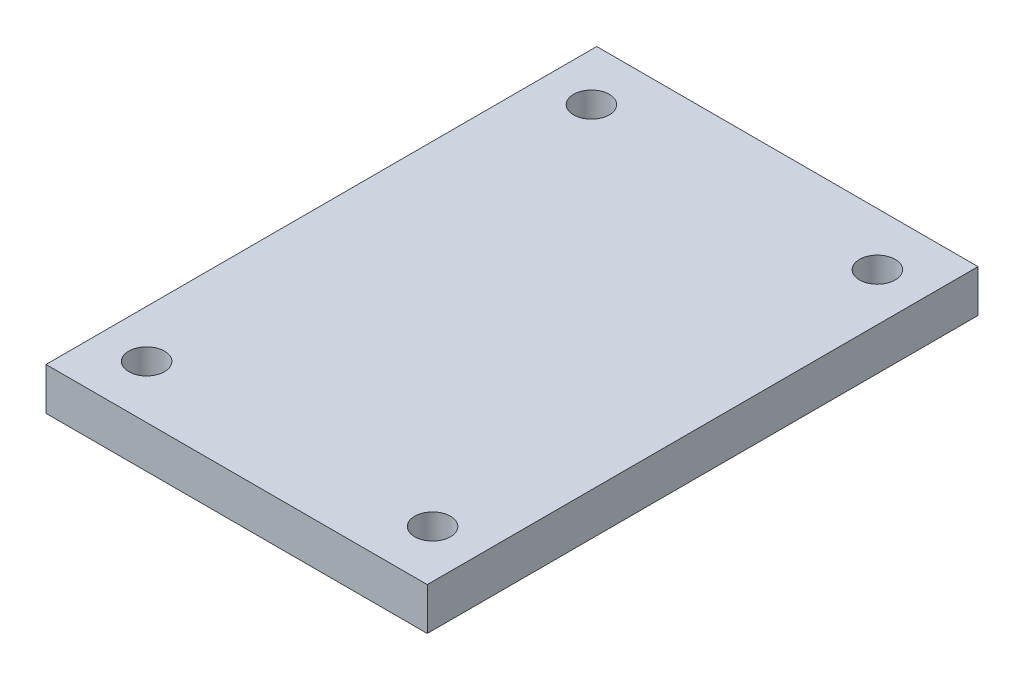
from build123d import *

# Parameters (mm, degrees)
SKETCH1_W               = 114.3
SKETCH1_H               = 165.1
BOSS_EXTRUDE1_DEPTH     = 12.7
F_1_2_13_TAPPED_HOLE1_D = 10.71626


with BuildPart() as part:
    # Sketch1 → Boss-Extrude1 (new body)
    with BuildSketch(Plane(origin=(0, 0, 0), x_dir=(1, 0, 0), z_dir=(0, 1, 0))):
        Rectangle(SKETCH1_W, SKETCH1_H)
    extrude(amount=BOSS_EXTRUDE1_DEPTH)

    # 1_2-13 Tapped Hole1 (through all)
    with Locations(Plane(origin=(0, 12.7, 0), x_dir=(1, 0, 0), z_dir=(0, 1, 0))):
        with Locations((-42.8625, 66.675), (42.8625, 66.675), (42.8625, -66.675), (-42.8625, -66.675)):
            Hole(F_1_2_13_TAPPED_HOLE1_D / 2)


solid = part.part
